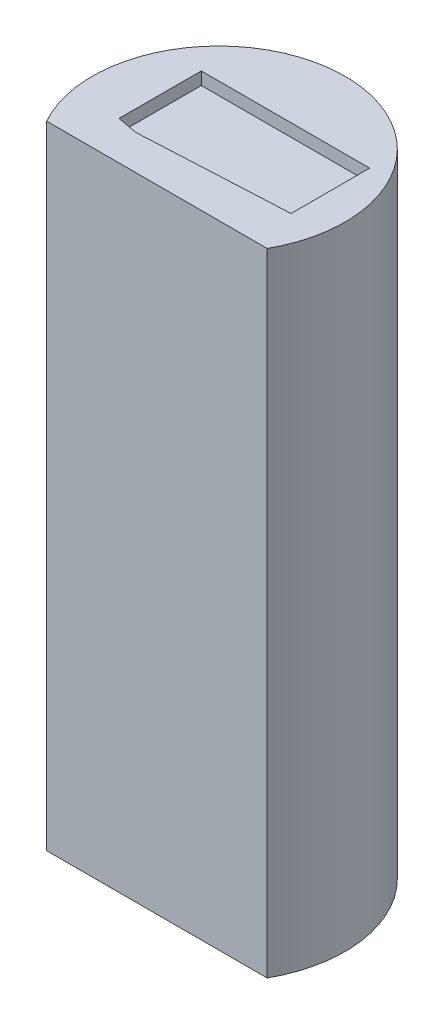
ISO-10303-21;
HEADER;
FILE_DESCRIPTION(('STEP AP214'),'2;1');
FILE_NAME('part.step','',(''),(''),'','','');
FILE_SCHEMA(('AUTOMOTIVE_DESIGN { 1 0 10303 214 1 1 1 1 }'));
ENDSEC;
DATA;
#1=APPLICATION_CONTEXT('core data for automotive mechanical design processes');
#2=APPLICATION_PROTOCOL_DEFINITION('international standard','automotive_design',2000,#1);
#3=PRODUCT_CONTEXT('',#1,'mechanical');
#4=PRODUCT('Part','Part','',(#3));
#5=PRODUCT_RELATED_PRODUCT_CATEGORY('part','',(#4));
#6=PRODUCT_DEFINITION_FORMATION('','',#4);
#7=PRODUCT_DEFINITION_CONTEXT('part definition',#1,'design');
#8=PRODUCT_DEFINITION('design','',#6,#7);
#9=PRODUCT_DEFINITION_SHAPE('','',#8);
#10=(LENGTH_UNIT() NAMED_UNIT(*) SI_UNIT(.MILLI.,.METRE.));
#11=(NAMED_UNIT(*) PLANE_ANGLE_UNIT() SI_UNIT($,.RADIAN.));
#12=(NAMED_UNIT(*) SI_UNIT($,.STERADIAN.) SOLID_ANGLE_UNIT());
#13=UNCERTAINTY_MEASURE_WITH_UNIT(LENGTH_MEASURE(1.E-05),#10,'distance_accuracy_value','');
#14=(GEOMETRIC_REPRESENTATION_CONTEXT(3) GLOBAL_UNCERTAINTY_ASSIGNED_CONTEXT((#13)) GLOBAL_UNIT_ASSIGNED_CONTEXT((#10,
#11,#12)) REPRESENTATION_CONTEXT('',''));
#15=CARTESIAN_POINT('',(0.,0.,0.));
#16=DIRECTION('',(0.,0.,1.));
#17=DIRECTION('',(1.,0.,0.));
#18=AXIS2_PLACEMENT_3D('',#15,#16,#17);
#19=CARTESIAN_POINT('',(0.,19.9,0.));
#20=DIRECTION('',(0.,1.,0.));
#21=DIRECTION('',(0.,0.,1.));
#22=AXIS2_PLACEMENT_3D('',#19,#20,#21);
#23=PLANE('',#22);
#24=DIRECTION('',(-1.,0.,0.));
#25=VECTOR('',#24,1.);
#26=CARTESIAN_POINT('',(8.72723381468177,19.9,-1.46759316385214));
#27=LINE('',#26,#25);
#28=CARTESIAN_POINT('',(8.72723381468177,19.9,-1.46759316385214));
#29=VERTEX_POINT('',#28);
#30=CARTESIAN_POINT('',(7.39517318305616,19.9,-1.46759316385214));
#31=VERTEX_POINT('',#30);
#32=EDGE_CURVE('E94',#29,#31,#27,.T.);
#33=ORIENTED_EDGE('',*,*,#32,.T.);
#34=DIRECTION('',(0.,0.,1.));
#35=VECTOR('',#34,1.);
#36=CARTESIAN_POINT('',(7.39517318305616,19.9,-1.46759316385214));
#37=LINE('',#36,#35);
#38=CARTESIAN_POINT('',(7.39517318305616,19.9,-0.816389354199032));
#39=VERTEX_POINT('',#38);
#40=EDGE_CURVE('E100',#31,#39,#37,.T.);
#41=ORIENTED_EDGE('',*,*,#40,.T.);
#42=DIRECTION('',(0.983735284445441,0.,0.17962430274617));
#43=VECTOR('',#42,1.);
#44=CARTESIAN_POINT('',(7.39517318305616,19.9,-0.816389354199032));
#45=LINE('',#44,#43);
#46=CARTESIAN_POINT('',(7.55532994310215,19.9,-0.787145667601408));
#47=VERTEX_POINT('',#46);
#48=EDGE_CURVE('E103',#39,#47,#45,.T.);
#49=ORIENTED_EDGE('',*,*,#48,.T.);
#50=DIRECTION('',(0.998756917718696,0.,-0.0498459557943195));
#51=VECTOR('',#50,1.);
#52=CARTESIAN_POINT('',(7.55532994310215,19.9,-0.787145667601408));
#53=LINE('',#52,#51);
#54=CARTESIAN_POINT('',(8.72723381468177,19.9,-0.845633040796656));
#55=VERTEX_POINT('',#54);
#56=EDGE_CURVE('E79',#47,#55,#53,.T.);
#57=ORIENTED_EDGE('',*,*,#56,.T.);
#58=DIRECTION('',(0.,0.,-1.));
#59=VECTOR('',#58,1.);
#60=CARTESIAN_POINT('',(8.72723381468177,19.9,-0.845633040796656));
#61=LINE('',#60,#59);
#62=EDGE_CURVE('E88',#55,#29,#61,.T.);
#63=ORIENTED_EDGE('',*,*,#62,.T.);
#64=EDGE_LOOP('',(#33,#41,#49,#57,#63));
#65=FACE_BOUND('',#64,.T.);
#66=ADVANCED_FACE('F17',(#65),#23,.T.);
#67=CARTESIAN_POINT('',(7.39517318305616,19.9,-0.816389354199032));
#68=DIRECTION('',(-0.17962430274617,0.,0.983735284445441));
#69=DIRECTION('',(0.983735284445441,0.,0.17962430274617));
#70=AXIS2_PLACEMENT_3D('',#67,#68,#69);
#71=PLANE('',#70);
#72=DIRECTION('',(0.,1.,0.));
#73=VECTOR('',#72,1.);
#74=CARTESIAN_POINT('',(7.55532994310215,19.9,-0.787145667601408));
#75=LINE('',#74,#73);
#76=CARTESIAN_POINT('',(7.55532994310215,20.,-0.787145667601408));
#77=VERTEX_POINT('',#76);
#78=EDGE_CURVE('E82',#77,#47,#75,.F.);
#79=ORIENTED_EDGE('',*,*,#78,.T.);
#80=ORIENTED_EDGE('',*,*,#48,.F.);
#81=DIRECTION('',(0.,1.,0.));
#82=VECTOR('',#81,1.);
#83=CARTESIAN_POINT('',(7.39517318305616,19.9,-0.816389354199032));
#84=LINE('',#83,#82);
#85=CARTESIAN_POINT('',(7.39517318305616,20.,-0.816389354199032));
#86=VERTEX_POINT('',#85);
#87=EDGE_CURVE('E97',#39,#86,#84,.T.);
#88=ORIENTED_EDGE('',*,*,#87,.T.);
#89=DIRECTION('',(-0.983735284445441,0.,-0.17962430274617));
#90=VECTOR('',#89,1.);
#91=CARTESIAN_POINT('',(7.55532994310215,20.,-0.787145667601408));
#92=LINE('',#91,#90);
#93=EDGE_CURVE('E73',#77,#86,#92,.T.);
#94=ORIENTED_EDGE('',*,*,#93,.F.);
#95=EDGE_LOOP('',(#79,#80,#88,#94));
#96=FACE_BOUND('',#95,.T.);
#97=ADVANCED_FACE('F118',(#96),#71,.F.);
#98=CARTESIAN_POINT('',(7.39517318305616,19.9,-1.46759316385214));
#99=DIRECTION('',(-1.,0.,0.));
#100=DIRECTION('',(0.,0.,1.));
#101=AXIS2_PLACEMENT_3D('',#98,#99,#100);
#102=PLANE('',#101);
#103=ORIENTED_EDGE('',*,*,#87,.F.);
#104=ORIENTED_EDGE('',*,*,#40,.F.);
#105=DIRECTION('',(0.,1.,0.));
#106=VECTOR('',#105,1.);
#107=CARTESIAN_POINT('',(7.39517318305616,19.9,-1.46759316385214));
#108=LINE('',#107,#106);
#109=CARTESIAN_POINT('',(7.39517318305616,20.,-1.46759316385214));
#110=VERTEX_POINT('',#109);
#111=EDGE_CURVE('E91',#31,#110,#108,.T.);
#112=ORIENTED_EDGE('',*,*,#111,.T.);
#113=DIRECTION('',(0.,0.,1.));
#114=VECTOR('',#113,1.);
#115=CARTESIAN_POINT('',(7.39517318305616,20.,-1.));
#116=LINE('',#115,#114);
#117=EDGE_CURVE('E70',#86,#110,#116,.F.);
#118=ORIENTED_EDGE('',*,*,#117,.F.);
#119=EDGE_LOOP('',(#103,#104,#112,#118));
#120=FACE_BOUND('',#119,.T.);
#121=ADVANCED_FACE('F143',(#120),#102,.F.);
#122=CARTESIAN_POINT('',(8.72723381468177,19.9,-1.46759316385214));
#123=DIRECTION('',(0.,0.,-1.));
#124=DIRECTION('',(-1.,0.,0.));
#125=AXIS2_PLACEMENT_3D('',#122,#123,#124);
#126=PLANE('',#125);
#127=ORIENTED_EDGE('',*,*,#111,.F.);
#128=ORIENTED_EDGE('',*,*,#32,.F.);
#129=DIRECTION('',(0.,1.,0.));
#130=VECTOR('',#129,1.);
#131=CARTESIAN_POINT('',(8.72723381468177,19.9,-1.46759316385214));
#132=LINE('',#131,#130);
#133=CARTESIAN_POINT('',(8.72723381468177,20.,-1.46759316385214));
#134=VERTEX_POINT('',#133);
#135=EDGE_CURVE('E85',#29,#134,#132,.T.);
#136=ORIENTED_EDGE('',*,*,#135,.T.);
#137=DIRECTION('',(1.,0.,0.));
#138=VECTOR('',#137,1.);
#139=CARTESIAN_POINT('',(8.,20.,-1.46759316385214));
#140=LINE('',#139,#138);
#141=EDGE_CURVE('E67',#110,#134,#140,.T.);
#142=ORIENTED_EDGE('',*,*,#141,.F.);
#143=EDGE_LOOP('',(#127,#128,#136,#142));
#144=FACE_BOUND('',#143,.T.);
#145=ADVANCED_FACE('F146',(#144),#126,.F.);
#146=CARTESIAN_POINT('',(8.72723381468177,19.9,-0.845633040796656));
#147=DIRECTION('',(1.,0.,0.));
#148=DIRECTION('',(0.,0.,-1.));
#149=AXIS2_PLACEMENT_3D('',#146,#147,#148);
#150=PLANE('',#149);
#151=ORIENTED_EDGE('',*,*,#135,.F.);
#152=ORIENTED_EDGE('',*,*,#62,.F.);
#153=DIRECTION('',(0.,1.,0.));
#154=VECTOR('',#153,1.);
#155=CARTESIAN_POINT('',(8.72723381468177,19.9,-0.845633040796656));
#156=LINE('',#155,#154);
#157=CARTESIAN_POINT('',(8.72723381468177,20.,-0.845633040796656));
#158=VERTEX_POINT('',#157);
#159=EDGE_CURVE('E76',#55,#158,#156,.T.);
#160=ORIENTED_EDGE('',*,*,#159,.T.);
#161=DIRECTION('',(0.,0.,1.));
#162=VECTOR('',#161,1.);
#163=CARTESIAN_POINT('',(8.72723381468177,20.,-1.));
#164=LINE('',#163,#162);
#165=EDGE_CURVE('E64',#134,#158,#164,.T.);
#166=ORIENTED_EDGE('',*,*,#165,.F.);
#167=EDGE_LOOP('',(#151,#152,#160,#166));
#168=FACE_BOUND('',#167,.T.);
#169=ADVANCED_FACE('F128',(#168),#150,.F.);
#170=CARTESIAN_POINT('',(7.55532994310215,19.9,-0.787145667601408));
#171=DIRECTION('',(0.0498459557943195,0.,0.998756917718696));
#172=DIRECTION('',(0.998756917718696,0.,-0.0498459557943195));
#173=AXIS2_PLACEMENT_3D('',#170,#171,#172);
#174=PLANE('',#173);
#175=ORIENTED_EDGE('',*,*,#159,.F.);
#176=ORIENTED_EDGE('',*,*,#56,.F.);
#177=ORIENTED_EDGE('',*,*,#78,.F.);
#178=DIRECTION('',(-0.998756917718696,0.,0.0498459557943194));
#179=VECTOR('',#178,1.);
#180=CARTESIAN_POINT('',(8.72723381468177,20.,-0.845633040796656));
#181=LINE('',#180,#179);
#182=EDGE_CURVE('E52',#158,#77,#181,.T.);
#183=ORIENTED_EDGE('',*,*,#182,.F.);
#184=EDGE_LOOP('',(#175,#176,#177,#183));
#185=FACE_BOUND('',#184,.T.);
#186=ADVANCED_FACE('F123',(#185),#174,.F.);
#187=CARTESIAN_POINT('',(8.,20.,-1.));
#188=DIRECTION('',(0.,1.,0.));
#189=DIRECTION('',(0.,0.,1.));
#190=AXIS2_PLACEMENT_3D('',#187,#188,#189);
#191=PLANE('',#190);
#192=DIRECTION('',(-1.,0.,0.));
#193=VECTOR('',#192,1.);
#194=CARTESIAN_POINT('',(6.62484899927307,20.,-0.511399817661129));
#195=LINE('',#194,#193);
#196=CARTESIAN_POINT('',(7.12749219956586,20.,-0.511399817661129));
#197=VERTEX_POINT('',#196);
#198=CARTESIAN_POINT('',(8.87250780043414,20.,-0.511399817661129));
#199=VERTEX_POINT('',#198);
#200=EDGE_CURVE('E44',#197,#199,#195,.F.);
#201=ORIENTED_EDGE('',*,*,#200,.T.);
#202=CARTESIAN_POINT('',(8.,20.,-1.));
#203=DIRECTION('',(0.,1.,0.));
#204=DIRECTION('',(0.,0.,1.));
#205=AXIS2_PLACEMENT_3D('',#202,#203,#204);
#206=CIRCLE('',#205,1.);
#207=EDGE_CURVE('E20',#197,#199,#206,.F.);
#208=ORIENTED_EDGE('',*,*,#207,.F.);
#209=EDGE_LOOP('',(#201,#208));
#210=FACE_BOUND('',#209,.T.);
#211=ORIENTED_EDGE('',*,*,#165,.T.);
#212=ORIENTED_EDGE('',*,*,#182,.T.);
#213=ORIENTED_EDGE('',*,*,#93,.T.);
#214=ORIENTED_EDGE('',*,*,#117,.T.);
#215=ORIENTED_EDGE('',*,*,#141,.T.);
#216=EDGE_LOOP('',(#211,#212,#213,#214,#215));
#217=FACE_BOUND('',#216,.T.);
#218=ADVANCED_FACE('F54',(#210,#217),#191,.T.);
#219=CARTESIAN_POINT('',(6.62484899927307,15.,-0.511399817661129));
#220=DIRECTION('',(0.,0.,-1.));
#221=DIRECTION('',(-1.,0.,0.));
#222=AXIS2_PLACEMENT_3D('',#219,#220,#221);
#223=PLANE('',#222);
#224=DIRECTION('',(1.,0.,0.));
#225=VECTOR('',#224,1.);
#226=CARTESIAN_POINT('',(8.,15.,-0.511399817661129));
#227=LINE('',#226,#225);
#228=CARTESIAN_POINT('',(7.12749219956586,15.,-0.511399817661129));
#229=VERTEX_POINT('',#228);
#230=CARTESIAN_POINT('',(8.87250780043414,15.,-0.511399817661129));
#231=VERTEX_POINT('',#230);
#232=EDGE_CURVE('E33',#229,#231,#227,.T.);
#233=ORIENTED_EDGE('',*,*,#232,.T.);
#234=DIRECTION('',(0.,1.,0.));
#235=VECTOR('',#234,1.);
#236=CARTESIAN_POINT('',(8.87250780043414,15.,-0.511399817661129));
#237=LINE('',#236,#235);
#238=EDGE_CURVE('E26',#199,#231,#237,.F.);
#239=ORIENTED_EDGE('',*,*,#238,.F.);
#240=ORIENTED_EDGE('',*,*,#200,.F.);
#241=DIRECTION('',(0.,1.,0.));
#242=VECTOR('',#241,1.);
#243=CARTESIAN_POINT('',(7.12749219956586,15.,-0.511399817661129));
#244=LINE('',#243,#242);
#245=EDGE_CURVE('E48',#229,#197,#244,.T.);
#246=ORIENTED_EDGE('',*,*,#245,.F.);
#247=EDGE_LOOP('',(#233,#239,#240,#246));
#248=FACE_BOUND('',#247,.T.);
#249=ADVANCED_FACE('F46',(#248),#223,.F.);
#250=CARTESIAN_POINT('',(8.,15.,-1.));
#251=DIRECTION('',(0.,1.,0.));
#252=DIRECTION('',(0.,0.,1.));
#253=AXIS2_PLACEMENT_3D('',#250,#251,#252);
#254=PLANE('',#253);
#255=ORIENTED_EDGE('',*,*,#232,.F.);
#256=CARTESIAN_POINT('',(8.,15.,-1.));
#257=DIRECTION('',(0.,1.,0.));
#258=DIRECTION('',(0.,0.,1.));
#259=AXIS2_PLACEMENT_3D('',#256,#257,#258);
#260=CIRCLE('',#259,1.);
#261=EDGE_CURVE('E11',#231,#229,#260,.T.);
#262=ORIENTED_EDGE('',*,*,#261,.F.);
#263=EDGE_LOOP('',(#255,#262));
#264=FACE_BOUND('',#263,.T.);
#265=ADVANCED_FACE('F154',(#264),#254,.F.);
#266=CARTESIAN_POINT('',(8.,15.,-1.));
#267=DIRECTION('',(0.,1.,0.));
#268=DIRECTION('',(0.,0.,1.));
#269=AXIS2_PLACEMENT_3D('',#266,#267,#268);
#270=CYLINDRICAL_SURFACE('',#269,1.);
#271=ORIENTED_EDGE('',*,*,#238,.T.);
#272=ORIENTED_EDGE('',*,*,#261,.T.);
#273=ORIENTED_EDGE('',*,*,#245,.T.);
#274=ORIENTED_EDGE('',*,*,#207,.T.);
#275=EDGE_LOOP('',(#271,#272,#273,#274));
#276=FACE_BOUND('',#275,.T.);
#277=ADVANCED_FACE('F57',(#276),#270,.T.);
#278=CLOSED_SHELL('',(#66,#97,#121,#145,#169,#186,#218,#249,#265,#277));
#279=MANIFOLD_SOLID_BREP('B1',#278);
#280=ADVANCED_BREP_SHAPE_REPRESENTATION('',(#18,#279),#14);
#281=SHAPE_DEFINITION_REPRESENTATION(#9,#280);
ENDSEC;
END-ISO-10303-21;
